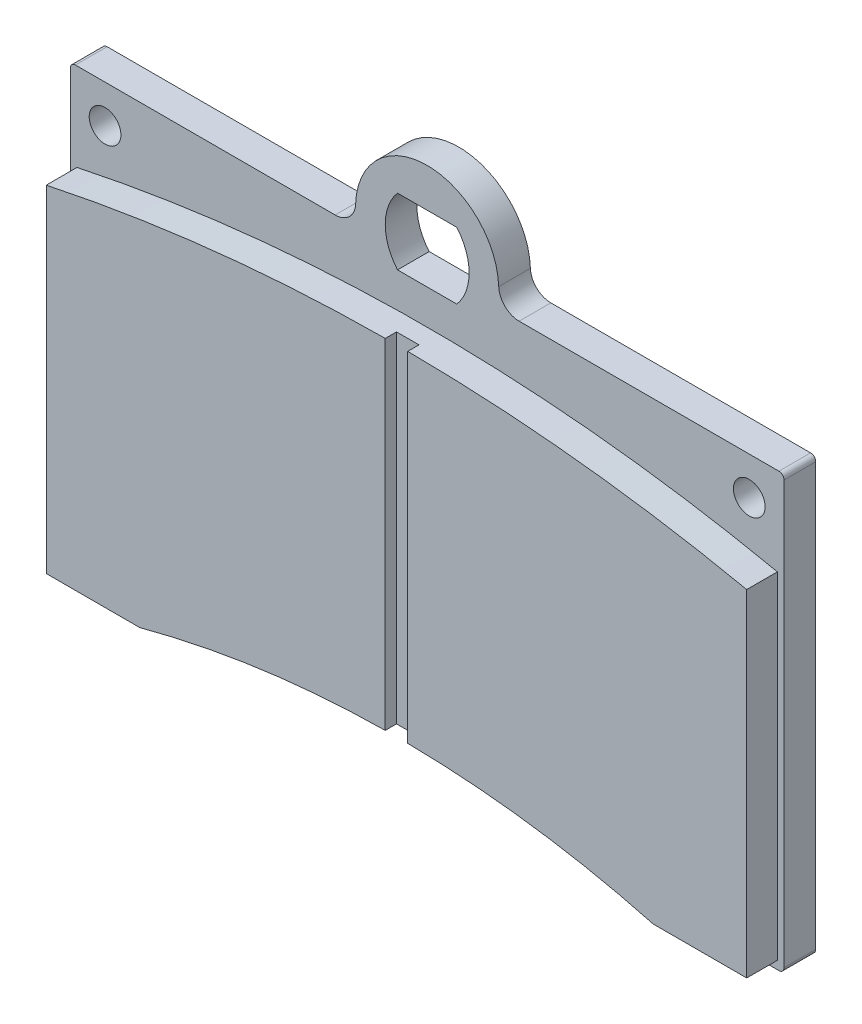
ISO-10303-21;
HEADER;
FILE_DESCRIPTION(('STEP AP214'),'2;1');
FILE_NAME('part.step','',(''),(''),'','','');
FILE_SCHEMA(('AUTOMOTIVE_DESIGN { 1 0 10303 214 1 1 1 1 }'));
ENDSEC;
DATA;
#1=APPLICATION_CONTEXT('core data for automotive mechanical design processes');
#2=APPLICATION_PROTOCOL_DEFINITION('international standard','automotive_design',2000,#1);
#3=PRODUCT_CONTEXT('',#1,'mechanical');
#4=PRODUCT('Part','Part','',(#3));
#5=PRODUCT_RELATED_PRODUCT_CATEGORY('part','',(#4));
#6=PRODUCT_DEFINITION_FORMATION('','',#4);
#7=PRODUCT_DEFINITION_CONTEXT('part definition',#1,'design');
#8=PRODUCT_DEFINITION('design','',#6,#7);
#9=PRODUCT_DEFINITION_SHAPE('','',#8);
#10=(LENGTH_UNIT() NAMED_UNIT(*) SI_UNIT(.MILLI.,.METRE.));
#11=(NAMED_UNIT(*) PLANE_ANGLE_UNIT() SI_UNIT($,.RADIAN.));
#12=(NAMED_UNIT(*) SI_UNIT($,.STERADIAN.) SOLID_ANGLE_UNIT());
#13=UNCERTAINTY_MEASURE_WITH_UNIT(LENGTH_MEASURE(1.E-05),#10,'distance_accuracy_value','');
#14=(GEOMETRIC_REPRESENTATION_CONTEXT(3) GLOBAL_UNCERTAINTY_ASSIGNED_CONTEXT((#13)) GLOBAL_UNIT_ASSIGNED_CONTEXT((#10,
#11,#12)) REPRESENTATION_CONTEXT('',''));
#15=CARTESIAN_POINT('',(0.,0.,0.));
#16=DIRECTION('',(0.,0.,1.));
#17=DIRECTION('',(1.,0.,0.));
#18=AXIS2_PLACEMENT_3D('',#15,#16,#17);
#19=CARTESIAN_POINT('',(0.,42.3,3.1));
#20=DIRECTION('',(0.,-1.,0.));
#21=DIRECTION('',(0.,0.,-1.));
#22=AXIS2_PLACEMENT_3D('',#19,#20,#21);
#23=PLANE('',#22);
#24=DIRECTION('',(-1.,0.,0.));
#25=VECTOR('',#24,1.);
#26=CARTESIAN_POINT('',(0.,42.3,3.1));
#27=LINE('',#26,#25);
#28=CARTESIAN_POINT('',(69.3,42.3,3.1));
#29=VERTEX_POINT('',#28);
#30=CARTESIAN_POINT('',(43.894998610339,42.3,3.1));
#31=VERTEX_POINT('',#30);
#32=EDGE_CURVE('E432',#29,#31,#27,.T.);
#33=ORIENTED_EDGE('',*,*,#32,.F.);
#34=DIRECTION('',(0.,0.,-1.));
#35=VECTOR('',#34,1.);
#36=CARTESIAN_POINT('',(69.3,42.3,3.1));
#37=LINE('',#36,#35);
#38=CARTESIAN_POINT('',(69.3,42.3,0.));
#39=VERTEX_POINT('',#38);
#40=EDGE_CURVE('E361',#29,#39,#37,.T.);
#41=ORIENTED_EDGE('',*,*,#40,.T.);
#42=DIRECTION('',(-1.,0.,0.));
#43=VECTOR('',#42,1.);
#44=CARTESIAN_POINT('',(0.,42.3,0.));
#45=LINE('',#44,#43);
#46=CARTESIAN_POINT('',(43.894998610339,42.3,0.));
#47=VERTEX_POINT('',#46);
#48=EDGE_CURVE('E405',#39,#47,#45,.T.);
#49=ORIENTED_EDGE('',*,*,#48,.T.);
#50=DIRECTION('',(0.,0.,1.));
#51=VECTOR('',#50,1.);
#52=CARTESIAN_POINT('',(43.894998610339,42.3,3.1));
#53=LINE('',#52,#51);
#54=EDGE_CURVE('E337',#47,#31,#53,.T.);
#55=ORIENTED_EDGE('',*,*,#54,.T.);
#56=EDGE_LOOP('',(#33,#41,#49,#55));
#57=FACE_BOUND('',#56,.T.);
#58=ADVANCED_FACE('F36',(#57),#23,.F.);
#59=CARTESIAN_POINT('',(34.9,-127.425347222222,6.1));
#60=DIRECTION('',(0.,0.,-1.));
#61=DIRECTION('',(-1.,0.,0.));
#62=AXIS2_PLACEMENT_3D('',#59,#60,#61);
#63=CYLINDRICAL_SURFACE('',#62,164.725347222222);
#64=CARTESIAN_POINT('',(34.9,-127.425347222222,5.));
#65=DIRECTION('',(0.,0.,-1.));
#66=DIRECTION('',(-1.,0.,0.));
#67=AXIS2_PLACEMENT_3D('',#64,#65,#66);
#68=CIRCLE('',#67,164.725347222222);
#69=CARTESIAN_POINT('',(33.8,37.2963271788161,5.));
#70=VERTEX_POINT('',#69);
#71=CARTESIAN_POINT('',(36.,37.2963271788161,5.));
#72=VERTEX_POINT('',#71);
#73=EDGE_CURVE('E453',#70,#72,#68,.T.);
#74=ORIENTED_EDGE('',*,*,#73,.T.);
#75=DIRECTION('',(0.,0.,-1.));
#76=VECTOR('',#75,1.);
#77=CARTESIAN_POINT('',(36.,37.2963271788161,6.1));
#78=LINE('',#77,#76);
#79=CARTESIAN_POINT('',(36.,37.2963271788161,6.1));
#80=VERTEX_POINT('',#79);
#81=EDGE_CURVE('E834',#72,#80,#78,.F.);
#82=ORIENTED_EDGE('',*,*,#81,.T.);
#83=CARTESIAN_POINT('',(34.9,-127.425347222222,6.1));
#84=DIRECTION('',(0.,0.,1.));
#85=DIRECTION('',(1.,0.,0.));
#86=AXIS2_PLACEMENT_3D('',#83,#84,#85);
#87=CIRCLE('',#86,164.725347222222);
#88=CARTESIAN_POINT('',(69.15,33.7,6.1));
#89=VERTEX_POINT('',#88);
#90=EDGE_CURVE('E822',#89,#80,#87,.T.);
#91=ORIENTED_EDGE('',*,*,#90,.F.);
#92=DIRECTION('',(0.,0.,-1.));
#93=VECTOR('',#92,1.);
#94=CARTESIAN_POINT('',(69.15,33.7,6.1));
#95=LINE('',#94,#93);
#96=CARTESIAN_POINT('',(69.15,33.7,3.1));
#97=VERTEX_POINT('',#96);
#98=EDGE_CURVE('E449',#89,#97,#95,.T.);
#99=ORIENTED_EDGE('',*,*,#98,.T.);
#100=CARTESIAN_POINT('',(34.9,-127.425347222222,3.1));
#101=DIRECTION('',(0.,0.,1.));
#102=DIRECTION('',(1.,0.,0.));
#103=AXIS2_PLACEMENT_3D('',#100,#101,#102);
#104=CIRCLE('',#103,164.725347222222);
#105=CARTESIAN_POINT('',(0.649999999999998,33.7,3.1));
#106=VERTEX_POINT('',#105);
#107=EDGE_CURVE('E450',#97,#106,#104,.T.);
#108=ORIENTED_EDGE('',*,*,#107,.T.);
#109=DIRECTION('',(0.,0.,-1.));
#110=VECTOR('',#109,1.);
#111=CARTESIAN_POINT('',(0.649999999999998,33.7,6.1));
#112=LINE('',#111,#110);
#113=CARTESIAN_POINT('',(0.649999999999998,33.7,6.1));
#114=VERTEX_POINT('',#113);
#115=EDGE_CURVE('E483',#114,#106,#112,.T.);
#116=ORIENTED_EDGE('',*,*,#115,.F.);
#117=CARTESIAN_POINT('',(33.8,37.2963271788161,6.1));
#118=VERTEX_POINT('',#117);
#119=EDGE_CURVE('E468',#118,#114,#87,.T.);
#120=ORIENTED_EDGE('',*,*,#119,.F.);
#121=DIRECTION('',(0.,0.,-1.));
#122=VECTOR('',#121,1.);
#123=CARTESIAN_POINT('',(33.8,37.2963271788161,6.1));
#124=LINE('',#123,#122);
#125=EDGE_CURVE('E827',#118,#70,#124,.T.);
#126=ORIENTED_EDGE('',*,*,#125,.T.);
#127=EDGE_LOOP('',(#74,#82,#91,#99,#108,#116,#120,#126));
#128=FACE_BOUND('',#127,.T.);
#129=ADVANCED_FACE('F552',(#128),#63,.T.);
#130=CARTESIAN_POINT('',(34.9,-127.425347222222,6.1));
#131=DIRECTION('',(0.,0.,1.));
#132=DIRECTION('',(1.,0.,0.));
#133=AXIS2_PLACEMENT_3D('',#130,#131,#132);
#134=PLANE('',#133);
#135=DIRECTION('',(0.,1.,0.));
#136=VECTOR('',#135,1.);
#137=CARTESIAN_POINT('',(36.,37.3,6.1));
#138=LINE('',#137,#136);
#139=CARTESIAN_POINT('',(36.,4.09377212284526,6.1));
#140=VERTEX_POINT('',#139);
#141=EDGE_CURVE('E275',#140,#80,#138,.T.);
#142=ORIENTED_EDGE('',*,*,#141,.F.);
#143=CARTESIAN_POINT('',(34.9,-93.0469696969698,6.1));
#144=DIRECTION('',(0.,0.,-1.));
#145=DIRECTION('',(-1.,0.,0.));
#146=AXIS2_PLACEMENT_3D('',#143,#144,#145);
#147=CIRCLE('',#146,97.1469696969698);
#148=CARTESIAN_POINT('',(60.005377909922,0.799999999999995,6.1));
#149=VERTEX_POINT('',#148);
#150=EDGE_CURVE('E439',#140,#149,#147,.T.);
#151=ORIENTED_EDGE('',*,*,#150,.T.);
#152=DIRECTION('',(1.,0.,0.));
#153=VECTOR('',#152,1.);
#154=CARTESIAN_POINT('',(69.15,0.8,6.1));
#155=LINE('',#154,#153);
#156=CARTESIAN_POINT('',(69.15,0.8,6.1));
#157=VERTEX_POINT('',#156);
#158=EDGE_CURVE('E438',#149,#157,#155,.T.);
#159=ORIENTED_EDGE('',*,*,#158,.T.);
#160=DIRECTION('',(0.,1.,0.));
#161=VECTOR('',#160,1.);
#162=CARTESIAN_POINT('',(69.15,33.7,6.1));
#163=LINE('',#162,#161);
#164=EDGE_CURVE('E447',#157,#89,#163,.T.);
#165=ORIENTED_EDGE('',*,*,#164,.T.);
#166=ORIENTED_EDGE('',*,*,#90,.T.);
#167=EDGE_LOOP('',(#142,#151,#159,#165,#166));
#168=FACE_BOUND('',#167,.T.);
#169=ADVANCED_FACE('F316',(#168),#134,.T.);
#170=CARTESIAN_POINT('',(0.,0.,3.1));
#171=DIRECTION('',(0.,0.,-1.));
#172=DIRECTION('',(-1.,0.,0.));
#173=AXIS2_PLACEMENT_3D('',#170,#171,#172);
#174=PLANE('',#173);
#175=CARTESIAN_POINT('',(66.4,38.6,3.1));
#176=DIRECTION('',(0.,0.,1.));
#177=DIRECTION('',(1.,0.,0.));
#178=AXIS2_PLACEMENT_3D('',#175,#176,#177);
#179=CIRCLE('',#178,1.54999999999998);
#180=CARTESIAN_POINT('',(67.95,38.6,3.1));
#181=VERTEX_POINT('',#180);
#182=EDGE_CURVE('E858',#181,#181,#179,.T.);
#183=ORIENTED_EDGE('',*,*,#182,.F.);
#184=EDGE_LOOP('',(#183));
#185=FACE_BOUND('',#184,.T.);
#186=CARTESIAN_POINT('',(3.4,38.6,3.1));
#187=DIRECTION('',(0.,0.,1.));
#188=DIRECTION('',(1.,0.,0.));
#189=AXIS2_PLACEMENT_3D('',#186,#187,#188);
#190=CIRCLE('',#189,1.54999999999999);
#191=CARTESIAN_POINT('',(4.94999999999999,38.6,3.1));
#192=VERTEX_POINT('',#191);
#193=EDGE_CURVE('E854',#192,#192,#190,.T.);
#194=ORIENTED_EDGE('',*,*,#193,.F.);
#195=EDGE_LOOP('',(#194));
#196=FACE_BOUND('',#195,.T.);
#197=DIRECTION('',(1.,0.,0.));
#198=VECTOR('',#197,1.);
#199=CARTESIAN_POINT('',(32.,40.7,3.1));
#200=LINE('',#199,#198);
#201=CARTESIAN_POINT('',(32.,40.7,3.1));
#202=VERTEX_POINT('',#201);
#203=CARTESIAN_POINT('',(37.8,40.7,3.1));
#204=VERTEX_POINT('',#203);
#205=EDGE_CURVE('E260',#202,#204,#200,.T.);
#206=ORIENTED_EDGE('',*,*,#205,.F.);
#207=CARTESIAN_POINT('',(35.8010416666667,43.95,3.1));
#208=DIRECTION('',(0.,0.,1.));
#209=DIRECTION('',(-1.,0.,0.));
#210=AXIS2_PLACEMENT_3D('',#207,#208,#209);
#211=CIRCLE('',#210,5.00104166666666);
#212=CARTESIAN_POINT('',(32.,47.2,3.1));
#213=VERTEX_POINT('',#212);
#214=EDGE_CURVE('E230',#213,#202,#211,.T.);
#215=ORIENTED_EDGE('',*,*,#214,.F.);
#216=DIRECTION('',(-1.,0.,0.));
#217=VECTOR('',#216,1.);
#218=CARTESIAN_POINT('',(32.,47.2,3.1));
#219=LINE('',#218,#217);
#220=CARTESIAN_POINT('',(37.8,47.2,3.1));
#221=VERTEX_POINT('',#220);
#222=EDGE_CURVE('E248',#221,#213,#219,.T.);
#223=ORIENTED_EDGE('',*,*,#222,.F.);
#224=CARTESIAN_POINT('',(33.9989583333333,43.95,3.1));
#225=DIRECTION('',(0.,0.,1.));
#226=DIRECTION('',(1.,0.,0.));
#227=AXIS2_PLACEMENT_3D('',#224,#225,#226);
#228=CIRCLE('',#227,5.00104166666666);
#229=EDGE_CURVE('E251',#204,#221,#228,.T.);
#230=ORIENTED_EDGE('',*,*,#229,.F.);
#231=EDGE_LOOP('',(#206,#215,#223,#230));
#232=FACE_BOUND('',#231,.T.);
#233=DIRECTION('',(0.,-1.,0.));
#234=VECTOR('',#233,1.);
#235=CARTESIAN_POINT('',(0.649999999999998,33.7,3.1));
#236=LINE('',#235,#234);
#237=CARTESIAN_POINT('',(0.650000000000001,0.8,3.1));
#238=VERTEX_POINT('',#237);
#239=EDGE_CURVE('E452',#106,#238,#236,.T.);
#240=ORIENTED_EDGE('',*,*,#239,.F.);
#241=ORIENTED_EDGE('',*,*,#107,.F.);
#242=DIRECTION('',(0.,1.,0.));
#243=VECTOR('',#242,1.);
#244=CARTESIAN_POINT('',(69.15,33.7,3.1));
#245=LINE('',#244,#243);
#246=CARTESIAN_POINT('',(69.15,0.8,3.1));
#247=VERTEX_POINT('',#246);
#248=EDGE_CURVE('E465',#247,#97,#245,.T.);
#249=ORIENTED_EDGE('',*,*,#248,.F.);
#250=DIRECTION('',(1.,0.,0.));
#251=VECTOR('',#250,1.);
#252=CARTESIAN_POINT('',(69.15,0.8,3.1));
#253=LINE('',#252,#251);
#254=CARTESIAN_POINT('',(60.005377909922,0.799999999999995,3.1));
#255=VERTEX_POINT('',#254);
#256=EDGE_CURVE('E462',#255,#247,#253,.T.);
#257=ORIENTED_EDGE('',*,*,#256,.F.);
#258=CARTESIAN_POINT('',(34.9,-93.0469696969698,3.1));
#259=DIRECTION('',(0.,0.,-1.));
#260=DIRECTION('',(-1.,0.,0.));
#261=AXIS2_PLACEMENT_3D('',#258,#259,#260);
#262=CIRCLE('',#261,97.1469696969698);
#263=CARTESIAN_POINT('',(9.79462209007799,0.799999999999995,3.1));
#264=VERTEX_POINT('',#263);
#265=EDGE_CURVE('E459',#264,#255,#262,.T.);
#266=ORIENTED_EDGE('',*,*,#265,.F.);
#267=DIRECTION('',(1.,0.,0.));
#268=VECTOR('',#267,1.);
#269=CARTESIAN_POINT('',(0.650000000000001,0.8,3.1));
#270=LINE('',#269,#268);
#271=EDGE_CURVE('E456',#238,#264,#270,.T.);
#272=ORIENTED_EDGE('',*,*,#271,.F.);
#273=EDGE_LOOP('',(#240,#241,#249,#257,#266,#272));
#274=FACE_BOUND('',#273,.T.);
#275=DIRECTION('',(0.,1.,0.));
#276=VECTOR('',#275,1.);
#277=CARTESIAN_POINT('',(69.8,0.,3.1));
#278=LINE('',#277,#276);
#279=CARTESIAN_POINT('',(69.8,0.5,3.1));
#280=VERTEX_POINT('',#279);
#281=CARTESIAN_POINT('',(69.8,41.8,3.1));
#282=VERTEX_POINT('',#281);
#283=EDGE_CURVE('E495',#280,#282,#278,.T.);
#284=ORIENTED_EDGE('',*,*,#283,.T.);
#285=CARTESIAN_POINT('',(69.3,41.8,3.1));
#286=DIRECTION('',(0.,0.,-1.));
#287=DIRECTION('',(-1.,0.,0.));
#288=AXIS2_PLACEMENT_3D('',#285,#286,#287);
#289=CIRCLE('',#288,0.5);
#290=EDGE_CURVE('E382',#282,#29,#289,.F.);
#291=ORIENTED_EDGE('',*,*,#290,.T.);
#292=ORIENTED_EDGE('',*,*,#32,.T.);
#293=CARTESIAN_POINT('',(43.894998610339,44.3,3.1));
#294=DIRECTION('',(0.,0.,-1.));
#295=DIRECTION('',(-1.,0.,0.));
#296=AXIS2_PLACEMENT_3D('',#293,#294,#295);
#297=CIRCLE('',#296,2.);
#298=CARTESIAN_POINT('',(41.8961100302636,44.2333333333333,3.1));
#299=VERTEX_POINT('',#298);
#300=EDGE_CURVE('E352',#31,#299,#297,.T.);
#301=ORIENTED_EDGE('',*,*,#300,.T.);
#302=CARTESIAN_POINT('',(34.9,44.,3.1));
#303=DIRECTION('',(0.,0.,1.));
#304=DIRECTION('',(1.,0.,0.));
#305=AXIS2_PLACEMENT_3D('',#302,#303,#304);
#306=CIRCLE('',#305,7.);
#307=CARTESIAN_POINT('',(27.9038899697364,44.2333333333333,3.1));
#308=VERTEX_POINT('',#307);
#309=EDGE_CURVE('E266',#299,#308,#306,.T.);
#310=ORIENTED_EDGE('',*,*,#309,.T.);
#311=CARTESIAN_POINT('',(25.905001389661,44.3,3.1));
#312=DIRECTION('',(0.,0.,-1.));
#313=DIRECTION('',(-1.,0.,0.));
#314=AXIS2_PLACEMENT_3D('',#311,#312,#313);
#315=CIRCLE('',#314,2.);
#316=CARTESIAN_POINT('',(25.905001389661,42.3,3.1));
#317=VERTEX_POINT('',#316);
#318=EDGE_CURVE('E359',#308,#317,#315,.T.);
#319=ORIENTED_EDGE('',*,*,#318,.T.);
#320=CARTESIAN_POINT('',(0.5,42.3,3.1));
#321=VERTEX_POINT('',#320);
#322=EDGE_CURVE('E496',#317,#321,#27,.T.);
#323=ORIENTED_EDGE('',*,*,#322,.T.);
#324=CARTESIAN_POINT('',(0.5,41.8,3.1));
#325=DIRECTION('',(0.,0.,-1.));
#326=DIRECTION('',(-1.,0.,0.));
#327=AXIS2_PLACEMENT_3D('',#324,#325,#326);
#328=CIRCLE('',#327,0.5);
#329=CARTESIAN_POINT('',(0.,41.8,3.1));
#330=VERTEX_POINT('',#329);
#331=EDGE_CURVE('E377',#321,#330,#328,.F.);
#332=ORIENTED_EDGE('',*,*,#331,.T.);
#333=DIRECTION('',(0.,-1.,0.));
#334=VECTOR('',#333,1.);
#335=CARTESIAN_POINT('',(0.,0.,3.1));
#336=LINE('',#335,#334);
#337=CARTESIAN_POINT('',(0.,0.5,3.1));
#338=VERTEX_POINT('',#337);
#339=EDGE_CURVE('E395',#330,#338,#336,.T.);
#340=ORIENTED_EDGE('',*,*,#339,.T.);
#341=CARTESIAN_POINT('',(0.5,0.5,3.1));
#342=DIRECTION('',(0.,0.,-1.));
#343=DIRECTION('',(-1.,0.,0.));
#344=AXIS2_PLACEMENT_3D('',#341,#342,#343);
#345=CIRCLE('',#344,0.5);
#346=CARTESIAN_POINT('',(0.5,0.,3.1));
#347=VERTEX_POINT('',#346);
#348=EDGE_CURVE('E59',#338,#347,#345,.F.);
#349=ORIENTED_EDGE('',*,*,#348,.T.);
#350=DIRECTION('',(1.,0.,0.));
#351=VECTOR('',#350,1.);
#352=CARTESIAN_POINT('',(0.,0.,3.1));
#353=LINE('',#352,#351);
#354=CARTESIAN_POINT('',(9.9,0.,3.1));
#355=VERTEX_POINT('',#354);
#356=EDGE_CURVE('E415',#347,#355,#353,.T.);
#357=ORIENTED_EDGE('',*,*,#356,.T.);
#358=CARTESIAN_POINT('',(34.9,-93.0469696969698,3.1));
#359=DIRECTION('',(0.,0.,1.));
#360=DIRECTION('',(-1.,0.,0.));
#361=AXIS2_PLACEMENT_3D('',#358,#359,#360);
#362=CIRCLE('',#361,96.3469696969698);
#363=CARTESIAN_POINT('',(59.9,0.,3.1));
#364=VERTEX_POINT('',#363);
#365=EDGE_CURVE('E486',#364,#355,#362,.T.);
#366=ORIENTED_EDGE('',*,*,#365,.F.);
#367=CARTESIAN_POINT('',(69.3,0.,3.1));
#368=VERTEX_POINT('',#367);
#369=EDGE_CURVE('E404',#364,#368,#353,.T.);
#370=ORIENTED_EDGE('',*,*,#369,.T.);
#371=CARTESIAN_POINT('',(69.3,0.5,3.1));
#372=DIRECTION('',(0.,0.,-1.));
#373=DIRECTION('',(-1.,0.,0.));
#374=AXIS2_PLACEMENT_3D('',#371,#372,#373);
#375=CIRCLE('',#374,0.5);
#376=EDGE_CURVE('E380',#368,#280,#375,.F.);
#377=ORIENTED_EDGE('',*,*,#376,.T.);
#378=EDGE_LOOP('',(#284,#291,#292,#301,#310,#319,#323,#332,#340,#349,#357,#366,#370,#377));
#379=FACE_BOUND('',#378,.T.);
#380=ADVANCED_FACE('F401',(#185,#196,#232,#274,#379),#174,.F.);
#381=CARTESIAN_POINT('',(0.,0.,3.1));
#382=DIRECTION('',(0.,1.,0.));
#383=DIRECTION('',(0.,0.,1.));
#384=AXIS2_PLACEMENT_3D('',#381,#382,#383);
#385=PLANE('',#384);
#386=ORIENTED_EDGE('',*,*,#356,.F.);
#387=DIRECTION('',(0.,0.,-1.));
#388=VECTOR('',#387,1.);
#389=CARTESIAN_POINT('',(0.5,0.,3.1));
#390=LINE('',#389,#388);
#391=CARTESIAN_POINT('',(0.5,0.,0.));
#392=VERTEX_POINT('',#391);
#393=EDGE_CURVE('E385',#347,#392,#390,.T.);
#394=ORIENTED_EDGE('',*,*,#393,.T.);
#395=DIRECTION('',(1.,0.,0.));
#396=VECTOR('',#395,1.);
#397=CARTESIAN_POINT('',(0.,0.,0.));
#398=LINE('',#397,#396);
#399=CARTESIAN_POINT('',(9.9,0.,0.));
#400=VERTEX_POINT('',#399);
#401=EDGE_CURVE('E413',#392,#400,#398,.T.);
#402=ORIENTED_EDGE('',*,*,#401,.T.);
#403=DIRECTION('',(0.,0.,1.));
#404=VECTOR('',#403,1.);
#405=CARTESIAN_POINT('',(9.9,0.,0.));
#406=LINE('',#405,#404);
#407=EDGE_CURVE('E488',#400,#355,#406,.T.);
#408=ORIENTED_EDGE('',*,*,#407,.T.);
#409=EDGE_LOOP('',(#386,#394,#402,#408));
#410=FACE_BOUND('',#409,.T.);
#411=ADVANCED_FACE('F411',(#410),#385,.F.);
#412=CARTESIAN_POINT('',(0.,0.,3.1));
#413=DIRECTION('',(1.,0.,0.));
#414=DIRECTION('',(0.,0.,-1.));
#415=AXIS2_PLACEMENT_3D('',#412,#413,#414);
#416=PLANE('',#415);
#417=DIRECTION('',(0.,-1.,0.));
#418=VECTOR('',#417,1.);
#419=CARTESIAN_POINT('',(0.,0.,0.));
#420=LINE('',#419,#418);
#421=CARTESIAN_POINT('',(0.,41.8,0.));
#422=VERTEX_POINT('',#421);
#423=CARTESIAN_POINT('',(0.,0.5,0.));
#424=VERTEX_POINT('',#423);
#425=EDGE_CURVE('E398',#422,#424,#420,.T.);
#426=ORIENTED_EDGE('',*,*,#425,.T.);
#427=DIRECTION('',(0.,0.,-1.));
#428=VECTOR('',#427,1.);
#429=CARTESIAN_POINT('',(0.,0.5,3.1));
#430=LINE('',#429,#428);
#431=EDGE_CURVE('E44',#424,#338,#430,.F.);
#432=ORIENTED_EDGE('',*,*,#431,.T.);
#433=ORIENTED_EDGE('',*,*,#339,.F.);
#434=DIRECTION('',(0.,0.,-1.));
#435=VECTOR('',#434,1.);
#436=CARTESIAN_POINT('',(0.,41.8,3.1));
#437=LINE('',#436,#435);
#438=EDGE_CURVE('E388',#330,#422,#437,.T.);
#439=ORIENTED_EDGE('',*,*,#438,.T.);
#440=EDGE_LOOP('',(#426,#432,#433,#439));
#441=FACE_BOUND('',#440,.T.);
#442=ADVANCED_FACE('F394',(#441),#416,.F.);
#443=CARTESIAN_POINT('',(59.9,0.,0.));
#444=VERTEX_POINT('',#443);
#445=CARTESIAN_POINT('',(69.3,0.,0.));
#446=VERTEX_POINT('',#445);
#447=EDGE_CURVE('E421',#444,#446,#398,.T.);
#448=ORIENTED_EDGE('',*,*,#447,.T.);
#449=DIRECTION('',(0.,0.,-1.));
#450=VECTOR('',#449,1.);
#451=CARTESIAN_POINT('',(69.3,0.,3.1));
#452=LINE('',#451,#450);
#453=EDGE_CURVE('E51',#446,#368,#452,.F.);
#454=ORIENTED_EDGE('',*,*,#453,.T.);
#455=ORIENTED_EDGE('',*,*,#369,.F.);
#456=DIRECTION('',(0.,0.,1.));
#457=VECTOR('',#456,1.);
#458=CARTESIAN_POINT('',(59.9,0.,0.));
#459=LINE('',#458,#457);
#460=EDGE_CURVE('E491',#444,#364,#459,.T.);
#461=ORIENTED_EDGE('',*,*,#460,.F.);
#462=EDGE_LOOP('',(#448,#454,#455,#461));
#463=FACE_BOUND('',#462,.T.);
#464=ADVANCED_FACE('F536',(#463),#385,.F.);
#465=CARTESIAN_POINT('',(69.8,0.,3.1));
#466=DIRECTION('',(-1.,0.,0.));
#467=DIRECTION('',(0.,0.,1.));
#468=AXIS2_PLACEMENT_3D('',#465,#466,#467);
#469=PLANE('',#468);
#470=DIRECTION('',(0.,1.,0.));
#471=VECTOR('',#470,1.);
#472=CARTESIAN_POINT('',(69.8,0.,0.));
#473=LINE('',#472,#471);
#474=CARTESIAN_POINT('',(69.8,0.5,0.));
#475=VERTEX_POINT('',#474);
#476=CARTESIAN_POINT('',(69.8,41.8,0.));
#477=VERTEX_POINT('',#476);
#478=EDGE_CURVE('E420',#475,#477,#473,.T.);
#479=ORIENTED_EDGE('',*,*,#478,.T.);
#480=DIRECTION('',(0.,0.,-1.));
#481=VECTOR('',#480,1.);
#482=CARTESIAN_POINT('',(69.8,41.8,3.1));
#483=LINE('',#482,#481);
#484=EDGE_CURVE('E375',#477,#282,#483,.F.);
#485=ORIENTED_EDGE('',*,*,#484,.T.);
#486=ORIENTED_EDGE('',*,*,#283,.F.);
#487=DIRECTION('',(0.,0.,-1.));
#488=VECTOR('',#487,1.);
#489=CARTESIAN_POINT('',(69.8,0.5,3.1));
#490=LINE('',#489,#488);
#491=EDGE_CURVE('E372',#280,#475,#490,.T.);
#492=ORIENTED_EDGE('',*,*,#491,.T.);
#493=EDGE_LOOP('',(#479,#485,#486,#492));
#494=FACE_BOUND('',#493,.T.);
#495=ADVANCED_FACE('F529',(#494),#469,.F.);
#496=CARTESIAN_POINT('',(25.905001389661,42.3,0.));
#497=VERTEX_POINT('',#496);
#498=CARTESIAN_POINT('',(0.5,42.3,0.));
#499=VERTEX_POINT('',#498);
#500=EDGE_CURVE('E424',#497,#499,#45,.T.);
#501=ORIENTED_EDGE('',*,*,#500,.T.);
#502=DIRECTION('',(0.,0.,-1.));
#503=VECTOR('',#502,1.);
#504=CARTESIAN_POINT('',(0.5,42.3,3.1));
#505=LINE('',#504,#503);
#506=EDGE_CURVE('E12',#499,#321,#505,.F.);
#507=ORIENTED_EDGE('',*,*,#506,.T.);
#508=ORIENTED_EDGE('',*,*,#322,.F.);
#509=DIRECTION('',(0.,0.,1.));
#510=VECTOR('',#509,1.);
#511=CARTESIAN_POINT('',(25.905001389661,42.3,3.1));
#512=LINE('',#511,#510);
#513=EDGE_CURVE('E349',#317,#497,#512,.F.);
#514=ORIENTED_EDGE('',*,*,#513,.T.);
#515=EDGE_LOOP('',(#501,#507,#508,#514));
#516=FACE_BOUND('',#515,.T.);
#517=ADVANCED_FACE('F507',(#516),#23,.F.);
#518=CARTESIAN_POINT('',(0.,0.,0.));
#519=DIRECTION('',(0.,0.,-1.));
#520=DIRECTION('',(-1.,0.,0.));
#521=AXIS2_PLACEMENT_3D('',#518,#519,#520);
#522=PLANE('',#521);
#523=CARTESIAN_POINT('',(66.4,38.6,0.));
#524=DIRECTION('',(0.,0.,1.));
#525=DIRECTION('',(1.,0.,0.));
#526=AXIS2_PLACEMENT_3D('',#523,#524,#525);
#527=CIRCLE('',#526,1.55);
#528=CARTESIAN_POINT('',(67.95,38.6,0.));
#529=VERTEX_POINT('',#528);
#530=EDGE_CURVE('E856',#529,#529,#527,.T.);
#531=ORIENTED_EDGE('',*,*,#530,.T.);
#532=EDGE_LOOP('',(#531));
#533=FACE_BOUND('',#532,.T.);
#534=CARTESIAN_POINT('',(3.4,38.6,0.));
#535=DIRECTION('',(0.,0.,1.));
#536=DIRECTION('',(1.,0.,0.));
#537=AXIS2_PLACEMENT_3D('',#534,#535,#536);
#538=CIRCLE('',#537,1.55);
#539=CARTESIAN_POINT('',(4.95,38.6,0.));
#540=VERTEX_POINT('',#539);
#541=EDGE_CURVE('E254',#540,#540,#538,.T.);
#542=ORIENTED_EDGE('',*,*,#541,.T.);
#543=EDGE_LOOP('',(#542));
#544=FACE_BOUND('',#543,.T.);
#545=CARTESIAN_POINT('',(35.8010416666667,43.95,0.));
#546=DIRECTION('',(0.,0.,1.));
#547=DIRECTION('',(-1.,0.,0.));
#548=AXIS2_PLACEMENT_3D('',#545,#546,#547);
#549=CIRCLE('',#548,5.00104166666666);
#550=CARTESIAN_POINT('',(32.,47.2,0.));
#551=VERTEX_POINT('',#550);
#552=CARTESIAN_POINT('',(32.,40.7,0.));
#553=VERTEX_POINT('',#552);
#554=EDGE_CURVE('E227',#551,#553,#549,.T.);
#555=ORIENTED_EDGE('',*,*,#554,.T.);
#556=DIRECTION('',(1.,0.,0.));
#557=VECTOR('',#556,1.);
#558=CARTESIAN_POINT('',(32.,40.7,0.));
#559=LINE('',#558,#557);
#560=CARTESIAN_POINT('',(37.8,40.7,0.));
#561=VERTEX_POINT('',#560);
#562=EDGE_CURVE('E239',#553,#561,#559,.T.);
#563=ORIENTED_EDGE('',*,*,#562,.T.);
#564=CARTESIAN_POINT('',(33.9989583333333,43.95,0.));
#565=DIRECTION('',(0.,0.,1.));
#566=DIRECTION('',(1.,0.,0.));
#567=AXIS2_PLACEMENT_3D('',#564,#565,#566);
#568=CIRCLE('',#567,5.00104166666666);
#569=CARTESIAN_POINT('',(37.8,47.2,0.));
#570=VERTEX_POINT('',#569);
#571=EDGE_CURVE('E243',#561,#570,#568,.T.);
#572=ORIENTED_EDGE('',*,*,#571,.T.);
#573=DIRECTION('',(-1.,0.,0.));
#574=VECTOR('',#573,1.);
#575=CARTESIAN_POINT('',(32.,47.2,0.));
#576=LINE('',#575,#574);
#577=EDGE_CURVE('E235',#570,#551,#576,.T.);
#578=ORIENTED_EDGE('',*,*,#577,.T.);
#579=EDGE_LOOP('',(#555,#563,#572,#578));
#580=FACE_BOUND('',#579,.T.);
#581=ORIENTED_EDGE('',*,*,#48,.F.);
#582=CARTESIAN_POINT('',(69.3,41.8,0.));
#583=DIRECTION('',(0.,0.,-1.));
#584=DIRECTION('',(-1.,0.,0.));
#585=AXIS2_PLACEMENT_3D('',#582,#583,#584);
#586=CIRCLE('',#585,0.5);
#587=EDGE_CURVE('E370',#39,#477,#586,.T.);
#588=ORIENTED_EDGE('',*,*,#587,.T.);
#589=ORIENTED_EDGE('',*,*,#478,.F.);
#590=CARTESIAN_POINT('',(69.3,0.5,0.));
#591=DIRECTION('',(0.,0.,-1.));
#592=DIRECTION('',(-1.,0.,0.));
#593=AXIS2_PLACEMENT_3D('',#590,#591,#592);
#594=CIRCLE('',#593,0.5);
#595=EDGE_CURVE('E368',#475,#446,#594,.T.);
#596=ORIENTED_EDGE('',*,*,#595,.T.);
#597=ORIENTED_EDGE('',*,*,#447,.F.);
#598=CARTESIAN_POINT('',(34.9,-93.0469696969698,0.));
#599=DIRECTION('',(0.,0.,1.));
#600=DIRECTION('',(-1.,0.,0.));
#601=AXIS2_PLACEMENT_3D('',#598,#599,#600);
#602=CIRCLE('',#601,96.3469696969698);
#603=EDGE_CURVE('E419',#444,#400,#602,.T.);
#604=ORIENTED_EDGE('',*,*,#603,.T.);
#605=ORIENTED_EDGE('',*,*,#401,.F.);
#606=CARTESIAN_POINT('',(0.5,0.5,0.));
#607=DIRECTION('',(0.,0.,-1.));
#608=DIRECTION('',(-1.,0.,0.));
#609=AXIS2_PLACEMENT_3D('',#606,#607,#608);
#610=CIRCLE('',#609,0.5);
#611=EDGE_CURVE('E366',#392,#424,#610,.T.);
#612=ORIENTED_EDGE('',*,*,#611,.T.);
#613=ORIENTED_EDGE('',*,*,#425,.F.);
#614=CARTESIAN_POINT('',(0.5,41.8,0.));
#615=DIRECTION('',(0.,0.,-1.));
#616=DIRECTION('',(-1.,0.,0.));
#617=AXIS2_PLACEMENT_3D('',#614,#615,#616);
#618=CIRCLE('',#617,0.5);
#619=EDGE_CURVE('E364',#422,#499,#618,.T.);
#620=ORIENTED_EDGE('',*,*,#619,.T.);
#621=ORIENTED_EDGE('',*,*,#500,.F.);
#622=CARTESIAN_POINT('',(25.905001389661,44.3,0.));
#623=DIRECTION('',(0.,0.,-1.));
#624=DIRECTION('',(-1.,0.,0.));
#625=AXIS2_PLACEMENT_3D('',#622,#623,#624);
#626=CIRCLE('',#625,2.);
#627=CARTESIAN_POINT('',(27.9038899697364,44.2333333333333,0.));
#628=VERTEX_POINT('',#627);
#629=EDGE_CURVE('E357',#497,#628,#626,.F.);
#630=ORIENTED_EDGE('',*,*,#629,.T.);
#631=CARTESIAN_POINT('',(34.9,44.,0.));
#632=DIRECTION('',(0.,0.,-1.));
#633=DIRECTION('',(-1.,0.,0.));
#634=AXIS2_PLACEMENT_3D('',#631,#632,#633);
#635=CIRCLE('',#634,7.);
#636=CARTESIAN_POINT('',(41.8961100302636,44.2333333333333,0.));
#637=VERTEX_POINT('',#636);
#638=EDGE_CURVE('E272',#637,#628,#635,.F.);
#639=ORIENTED_EDGE('',*,*,#638,.F.);
#640=CARTESIAN_POINT('',(43.894998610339,44.3,0.));
#641=DIRECTION('',(0.,0.,-1.));
#642=DIRECTION('',(-1.,0.,0.));
#643=AXIS2_PLACEMENT_3D('',#640,#641,#642);
#644=CIRCLE('',#643,2.);
#645=EDGE_CURVE('E354',#637,#47,#644,.F.);
#646=ORIENTED_EDGE('',*,*,#645,.T.);
#647=EDGE_LOOP('',(#581,#588,#589,#596,#597,#604,#605,#612,#613,#620,#621,#630,#639,#646));
#648=FACE_BOUND('',#647,.T.);
#649=ADVANCED_FACE('F245',(#533,#544,#580,#648),#522,.T.);
#650=CARTESIAN_POINT('',(34.9,-93.0469696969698,0.));
#651=DIRECTION('',(0.,0.,1.));
#652=DIRECTION('',(1.,0.,0.));
#653=AXIS2_PLACEMENT_3D('',#650,#651,#652);
#654=CYLINDRICAL_SURFACE('',#653,96.3469696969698);
#655=ORIENTED_EDGE('',*,*,#365,.T.);
#656=ORIENTED_EDGE('',*,*,#407,.F.);
#657=ORIENTED_EDGE('',*,*,#603,.F.);
#658=ORIENTED_EDGE('',*,*,#460,.T.);
#659=EDGE_LOOP('',(#655,#656,#657,#658));
#660=FACE_BOUND('',#659,.T.);
#661=ADVANCED_FACE('F538',(#660),#654,.F.);
#662=CARTESIAN_POINT('',(0.649999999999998,33.7,6.1));
#663=DIRECTION('',(1.,0.,0.));
#664=DIRECTION('',(0.,1.,0.));
#665=AXIS2_PLACEMENT_3D('',#662,#663,#664);
#666=PLANE('',#665);
#667=ORIENTED_EDGE('',*,*,#239,.T.);
#668=DIRECTION('',(0.,0.,-1.));
#669=VECTOR('',#668,1.);
#670=CARTESIAN_POINT('',(0.650000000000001,0.8,6.1));
#671=LINE('',#670,#669);
#672=CARTESIAN_POINT('',(0.650000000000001,0.8,6.1));
#673=VERTEX_POINT('',#672);
#674=EDGE_CURVE('E480',#673,#238,#671,.T.);
#675=ORIENTED_EDGE('',*,*,#674,.F.);
#676=DIRECTION('',(0.,-1.,0.));
#677=VECTOR('',#676,1.);
#678=CARTESIAN_POINT('',(0.649999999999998,33.7,6.1));
#679=LINE('',#678,#677);
#680=EDGE_CURVE('E821',#114,#673,#679,.T.);
#681=ORIENTED_EDGE('',*,*,#680,.F.);
#682=ORIENTED_EDGE('',*,*,#115,.T.);
#683=EDGE_LOOP('',(#667,#675,#681,#682));
#684=FACE_BOUND('',#683,.T.);
#685=ADVANCED_FACE('F540',(#684),#666,.F.);
#686=CARTESIAN_POINT('',(0.650000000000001,0.8,6.1));
#687=DIRECTION('',(0.,1.,0.));
#688=DIRECTION('',(-1.,0.,0.));
#689=AXIS2_PLACEMENT_3D('',#686,#687,#688);
#690=PLANE('',#689);
#691=ORIENTED_EDGE('',*,*,#271,.T.);
#692=DIRECTION('',(0.,0.,-1.));
#693=VECTOR('',#692,1.);
#694=CARTESIAN_POINT('',(9.79462209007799,0.799999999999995,6.1));
#695=LINE('',#694,#693);
#696=CARTESIAN_POINT('',(9.79462209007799,0.799999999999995,6.1));
#697=VERTEX_POINT('',#696);
#698=EDGE_CURVE('E477',#697,#264,#695,.T.);
#699=ORIENTED_EDGE('',*,*,#698,.F.);
#700=DIRECTION('',(1.,0.,0.));
#701=VECTOR('',#700,1.);
#702=CARTESIAN_POINT('',(0.650000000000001,0.8,6.1));
#703=LINE('',#702,#701);
#704=EDGE_CURVE('E443',#673,#697,#703,.T.);
#705=ORIENTED_EDGE('',*,*,#704,.F.);
#706=ORIENTED_EDGE('',*,*,#674,.T.);
#707=EDGE_LOOP('',(#691,#699,#705,#706));
#708=FACE_BOUND('',#707,.T.);
#709=ADVANCED_FACE('F328',(#708),#690,.F.);
#710=CARTESIAN_POINT('',(34.9,-93.0469696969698,6.1));
#711=DIRECTION('',(0.,0.,-1.));
#712=DIRECTION('',(-1.,0.,0.));
#713=AXIS2_PLACEMENT_3D('',#710,#711,#712);
#714=CYLINDRICAL_SURFACE('',#713,97.1469696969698);
#715=ORIENTED_EDGE('',*,*,#150,.F.);
#716=DIRECTION('',(0.,0.,1.));
#717=VECTOR('',#716,1.);
#718=CARTESIAN_POINT('',(36.,4.09377212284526,-33.2790259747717));
#719=LINE('',#718,#717);
#720=CARTESIAN_POINT('',(36.,4.09377212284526,5.));
#721=VERTEX_POINT('',#720);
#722=EDGE_CURVE('E283',#721,#140,#719,.T.);
#723=ORIENTED_EDGE('',*,*,#722,.F.);
#724=CARTESIAN_POINT('',(34.9,-93.0469696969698,5.));
#725=DIRECTION('',(0.,0.,1.));
#726=DIRECTION('',(0.011323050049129,0.999935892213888,0.));
#727=AXIS2_PLACEMENT_3D('',#724,#725,#726);
#728=CIRCLE('',#727,97.1469696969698);
#729=CARTESIAN_POINT('',(33.8,4.09377212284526,5.));
#730=VERTEX_POINT('',#729);
#731=EDGE_CURVE('E291',#721,#730,#728,.T.);
#732=ORIENTED_EDGE('',*,*,#731,.T.);
#733=DIRECTION('',(0.,0.,1.));
#734=VECTOR('',#733,1.);
#735=CARTESIAN_POINT('',(33.8,4.09377212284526,-33.2790259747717));
#736=LINE('',#735,#734);
#737=CARTESIAN_POINT('',(33.8,4.09377212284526,6.1));
#738=VERTEX_POINT('',#737);
#739=EDGE_CURVE('E817',#730,#738,#736,.T.);
#740=ORIENTED_EDGE('',*,*,#739,.T.);
#741=EDGE_CURVE('E435',#697,#738,#147,.T.);
#742=ORIENTED_EDGE('',*,*,#741,.F.);
#743=ORIENTED_EDGE('',*,*,#698,.T.);
#744=ORIENTED_EDGE('',*,*,#265,.T.);
#745=DIRECTION('',(0.,0.,-1.));
#746=VECTOR('',#745,1.);
#747=CARTESIAN_POINT('',(60.005377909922,0.799999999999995,6.1));
#748=LINE('',#747,#746);
#749=EDGE_CURVE('E474',#149,#255,#748,.T.);
#750=ORIENTED_EDGE('',*,*,#749,.F.);
#751=EDGE_LOOP('',(#715,#723,#732,#740,#742,#743,#744,#750));
#752=FACE_BOUND('',#751,.T.);
#753=ADVANCED_FACE('F323',(#752),#714,.F.);
#754=CARTESIAN_POINT('',(69.15,0.8,6.1));
#755=DIRECTION('',(0.,1.,0.));
#756=DIRECTION('',(-1.,0.,0.));
#757=AXIS2_PLACEMENT_3D('',#754,#755,#756);
#758=PLANE('',#757);
#759=ORIENTED_EDGE('',*,*,#256,.T.);
#760=DIRECTION('',(0.,0.,-1.));
#761=VECTOR('',#760,1.);
#762=CARTESIAN_POINT('',(69.15,0.8,6.1));
#763=LINE('',#762,#761);
#764=EDGE_CURVE('E471',#157,#247,#763,.T.);
#765=ORIENTED_EDGE('',*,*,#764,.F.);
#766=ORIENTED_EDGE('',*,*,#158,.F.);
#767=ORIENTED_EDGE('',*,*,#749,.T.);
#768=EDGE_LOOP('',(#759,#765,#766,#767));
#769=FACE_BOUND('',#768,.T.);
#770=ADVANCED_FACE('F319',(#769),#758,.F.);
#771=CARTESIAN_POINT('',(69.15,33.7,6.1));
#772=DIRECTION('',(-1.,0.,0.));
#773=DIRECTION('',(0.,0.,1.));
#774=AXIS2_PLACEMENT_3D('',#771,#772,#773);
#775=PLANE('',#774);
#776=ORIENTED_EDGE('',*,*,#248,.T.);
#777=ORIENTED_EDGE('',*,*,#98,.F.);
#778=ORIENTED_EDGE('',*,*,#164,.F.);
#779=ORIENTED_EDGE('',*,*,#764,.T.);
#780=EDGE_LOOP('',(#776,#777,#778,#779));
#781=FACE_BOUND('',#780,.T.);
#782=ADVANCED_FACE('F314',(#781),#775,.F.);
#783=DIRECTION('',(0.,-1.,0.));
#784=VECTOR('',#783,1.);
#785=CARTESIAN_POINT('',(33.8,-127.425347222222,6.1));
#786=LINE('',#785,#784);
#787=EDGE_CURVE('E430',#118,#738,#786,.T.);
#788=ORIENTED_EDGE('',*,*,#787,.F.);
#789=ORIENTED_EDGE('',*,*,#119,.T.);
#790=ORIENTED_EDGE('',*,*,#680,.T.);
#791=ORIENTED_EDGE('',*,*,#704,.T.);
#792=ORIENTED_EDGE('',*,*,#741,.T.);
#793=EDGE_LOOP('',(#788,#789,#790,#791,#792));
#794=FACE_BOUND('',#793,.T.);
#795=ADVANCED_FACE('F310',(#794),#134,.T.);
#796=CARTESIAN_POINT('',(0.,0.,5.));
#797=DIRECTION('',(0.,0.,-1.));
#798=DIRECTION('',(-1.,0.,0.));
#799=AXIS2_PLACEMENT_3D('',#796,#797,#798);
#800=PLANE('',#799);
#801=DIRECTION('',(0.,-1.,0.));
#802=VECTOR('',#801,1.);
#803=CARTESIAN_POINT('',(33.8,37.3,5.));
#804=LINE('',#803,#802);
#805=EDGE_CURVE('E825',#70,#730,#804,.T.);
#806=ORIENTED_EDGE('',*,*,#805,.T.);
#807=ORIENTED_EDGE('',*,*,#731,.F.);
#808=DIRECTION('',(0.,1.,0.));
#809=VECTOR('',#808,1.);
#810=CARTESIAN_POINT('',(36.,37.3,5.));
#811=LINE('',#810,#809);
#812=EDGE_CURVE('E297',#721,#72,#811,.T.);
#813=ORIENTED_EDGE('',*,*,#812,.T.);
#814=ORIENTED_EDGE('',*,*,#73,.F.);
#815=EDGE_LOOP('',(#806,#807,#813,#814));
#816=FACE_BOUND('',#815,.T.);
#817=ADVANCED_FACE('F299',(#816),#800,.F.);
#818=CARTESIAN_POINT('',(36.,37.3,-33.2790259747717));
#819=DIRECTION('',(1.,0.,0.));
#820=DIRECTION('',(0.,1.,0.));
#821=AXIS2_PLACEMENT_3D('',#818,#819,#820);
#822=PLANE('',#821);
#823=ORIENTED_EDGE('',*,*,#812,.F.);
#824=ORIENTED_EDGE('',*,*,#722,.T.);
#825=ORIENTED_EDGE('',*,*,#141,.T.);
#826=ORIENTED_EDGE('',*,*,#81,.F.);
#827=EDGE_LOOP('',(#823,#824,#825,#826));
#828=FACE_BOUND('',#827,.T.);
#829=ADVANCED_FACE('F309',(#828),#822,.F.);
#830=CARTESIAN_POINT('',(33.8,37.3,-33.2790259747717));
#831=DIRECTION('',(-1.,0.,0.));
#832=DIRECTION('',(0.,0.,1.));
#833=AXIS2_PLACEMENT_3D('',#830,#831,#832);
#834=PLANE('',#833);
#835=ORIENTED_EDGE('',*,*,#787,.T.);
#836=ORIENTED_EDGE('',*,*,#739,.F.);
#837=ORIENTED_EDGE('',*,*,#805,.F.);
#838=ORIENTED_EDGE('',*,*,#125,.F.);
#839=EDGE_LOOP('',(#835,#836,#837,#838));
#840=FACE_BOUND('',#839,.T.);
#841=ADVANCED_FACE('F726',(#840),#834,.F.);
#842=CARTESIAN_POINT('',(34.9,44.,-19.7989898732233));
#843=DIRECTION('',(0.,0.,1.));
#844=DIRECTION('',(1.,0.,0.));
#845=AXIS2_PLACEMENT_3D('',#842,#843,#844);
#846=CYLINDRICAL_SURFACE('',#845,7.);
#847=ORIENTED_EDGE('',*,*,#309,.F.);
#848=DIRECTION('',(0.,0.,1.));
#849=VECTOR('',#848,1.);
#850=CARTESIAN_POINT('',(41.8961100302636,44.2333333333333,-19.7989898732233));
#851=LINE('',#850,#849);
#852=EDGE_CURVE('E347',#299,#637,#851,.F.);
#853=ORIENTED_EDGE('',*,*,#852,.T.);
#854=ORIENTED_EDGE('',*,*,#638,.T.);
#855=DIRECTION('',(0.,0.,1.));
#856=VECTOR('',#855,1.);
#857=CARTESIAN_POINT('',(27.9038899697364,44.2333333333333,-19.7989898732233));
#858=LINE('',#857,#856);
#859=EDGE_CURVE('E345',#628,#308,#858,.T.);
#860=ORIENTED_EDGE('',*,*,#859,.T.);
#861=EDGE_LOOP('',(#847,#853,#854,#860));
#862=FACE_BOUND('',#861,.T.);
#863=ADVANCED_FACE('F515',(#862),#846,.T.);
#864=CARTESIAN_POINT('',(43.894998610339,44.3,-19.7989898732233));
#865=DIRECTION('',(0.,0.,1.));
#866=DIRECTION('',(1.,0.,0.));
#867=AXIS2_PLACEMENT_3D('',#864,#865,#866);
#868=CYLINDRICAL_SURFACE('',#867,2.);
#869=ORIENTED_EDGE('',*,*,#645,.F.);
#870=ORIENTED_EDGE('',*,*,#852,.F.);
#871=ORIENTED_EDGE('',*,*,#300,.F.);
#872=ORIENTED_EDGE('',*,*,#54,.F.);
#873=EDGE_LOOP('',(#869,#870,#871,#872));
#874=FACE_BOUND('',#873,.T.);
#875=ADVANCED_FACE('F518',(#874),#868,.F.);
#876=CARTESIAN_POINT('',(25.905001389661,44.3,-19.7989898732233));
#877=DIRECTION('',(0.,0.,1.));
#878=DIRECTION('',(1.,0.,0.));
#879=AXIS2_PLACEMENT_3D('',#876,#877,#878);
#880=CYLINDRICAL_SURFACE('',#879,2.);
#881=ORIENTED_EDGE('',*,*,#318,.F.);
#882=ORIENTED_EDGE('',*,*,#859,.F.);
#883=ORIENTED_EDGE('',*,*,#629,.F.);
#884=ORIENTED_EDGE('',*,*,#513,.F.);
#885=EDGE_LOOP('',(#881,#882,#883,#884));
#886=FACE_BOUND('',#885,.T.);
#887=ADVANCED_FACE('F509',(#886),#880,.F.);
#888=CARTESIAN_POINT('',(35.8010416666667,43.95,0.));
#889=DIRECTION('',(0.,0.,1.));
#890=DIRECTION('',(1.,0.,0.));
#891=AXIS2_PLACEMENT_3D('',#888,#889,#890);
#892=CYLINDRICAL_SURFACE('',#891,5.00104166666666);
#893=ORIENTED_EDGE('',*,*,#214,.T.);
#894=DIRECTION('',(0.,0.,1.));
#895=VECTOR('',#894,1.);
#896=CARTESIAN_POINT('',(32.,40.7,0.));
#897=LINE('',#896,#895);
#898=EDGE_CURVE('E223',#553,#202,#897,.T.);
#899=ORIENTED_EDGE('',*,*,#898,.F.);
#900=ORIENTED_EDGE('',*,*,#554,.F.);
#901=DIRECTION('',(0.,0.,1.));
#902=VECTOR('',#901,1.);
#903=CARTESIAN_POINT('',(32.,47.2,0.));
#904=LINE('',#903,#902);
#905=EDGE_CURVE('E264',#551,#213,#904,.T.);
#906=ORIENTED_EDGE('',*,*,#905,.T.);
#907=EDGE_LOOP('',(#893,#899,#900,#906));
#908=FACE_BOUND('',#907,.T.);
#909=ADVANCED_FACE('F225',(#908),#892,.F.);
#910=CARTESIAN_POINT('',(32.,47.2,0.));
#911=DIRECTION('',(0.,1.,0.));
#912=DIRECTION('',(-1.,0.,0.));
#913=AXIS2_PLACEMENT_3D('',#910,#911,#912);
#914=PLANE('',#913);
#915=ORIENTED_EDGE('',*,*,#222,.T.);
#916=ORIENTED_EDGE('',*,*,#905,.F.);
#917=ORIENTED_EDGE('',*,*,#577,.F.);
#918=DIRECTION('',(0.,0.,1.));
#919=VECTOR('',#918,1.);
#920=CARTESIAN_POINT('',(37.8,47.2,0.));
#921=LINE('',#920,#919);
#922=EDGE_CURVE('E267',#570,#221,#921,.T.);
#923=ORIENTED_EDGE('',*,*,#922,.T.);
#924=EDGE_LOOP('',(#915,#916,#917,#923));
#925=FACE_BOUND('',#924,.T.);
#926=ADVANCED_FACE('F688',(#925),#914,.F.);
#927=CARTESIAN_POINT('',(33.9989583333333,43.95,0.));
#928=DIRECTION('',(0.,0.,1.));
#929=DIRECTION('',(1.,0.,0.));
#930=AXIS2_PLACEMENT_3D('',#927,#928,#929);
#931=CYLINDRICAL_SURFACE('',#930,5.00104166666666);
#932=ORIENTED_EDGE('',*,*,#229,.T.);
#933=ORIENTED_EDGE('',*,*,#922,.F.);
#934=ORIENTED_EDGE('',*,*,#571,.F.);
#935=DIRECTION('',(0.,0.,1.));
#936=VECTOR('',#935,1.);
#937=CARTESIAN_POINT('',(37.8,40.7,0.));
#938=LINE('',#937,#936);
#939=EDGE_CURVE('E234',#561,#204,#938,.T.);
#940=ORIENTED_EDGE('',*,*,#939,.T.);
#941=EDGE_LOOP('',(#932,#933,#934,#940));
#942=FACE_BOUND('',#941,.T.);
#943=ADVANCED_FACE('F679',(#942),#931,.F.);
#944=CARTESIAN_POINT('',(32.,40.7,0.));
#945=DIRECTION('',(0.,-1.,0.));
#946=DIRECTION('',(0.,0.,-1.));
#947=AXIS2_PLACEMENT_3D('',#944,#945,#946);
#948=PLANE('',#947);
#949=ORIENTED_EDGE('',*,*,#205,.T.);
#950=ORIENTED_EDGE('',*,*,#939,.F.);
#951=ORIENTED_EDGE('',*,*,#562,.F.);
#952=ORIENTED_EDGE('',*,*,#898,.T.);
#953=EDGE_LOOP('',(#949,#950,#951,#952));
#954=FACE_BOUND('',#953,.T.);
#955=ADVANCED_FACE('F240',(#954),#948,.F.);
#956=CARTESIAN_POINT('',(3.4,38.6,3.1));
#957=DIRECTION('',(0.,0.,1.));
#958=DIRECTION('',(1.,0.,0.));
#959=AXIS2_PLACEMENT_3D('',#956,#957,#958);
#960=CYLINDRICAL_SURFACE('',#959,1.54999999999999);
#961=ORIENTED_EDGE('',*,*,#541,.F.);
#962=EDGE_LOOP('',(#961));
#963=FACE_BOUND('',#962,.T.);
#964=ORIENTED_EDGE('',*,*,#193,.T.);
#965=EDGE_LOOP('',(#964));
#966=FACE_BOUND('',#965,.T.);
#967=ADVANCED_FACE('F660',(#963,#966),#960,.F.);
#968=CARTESIAN_POINT('',(66.4,38.6,3.1));
#969=DIRECTION('',(0.,0.,1.));
#970=DIRECTION('',(1.,0.,0.));
#971=AXIS2_PLACEMENT_3D('',#968,#969,#970);
#972=CYLINDRICAL_SURFACE('',#971,1.54999999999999);
#973=ORIENTED_EDGE('',*,*,#530,.F.);
#974=EDGE_LOOP('',(#973));
#975=FACE_BOUND('',#974,.T.);
#976=ORIENTED_EDGE('',*,*,#182,.T.);
#977=EDGE_LOOP('',(#976));
#978=FACE_BOUND('',#977,.T.);
#979=ADVANCED_FACE('F576',(#975,#978),#972,.F.);
#980=CARTESIAN_POINT('',(69.3,41.8,3.1));
#981=DIRECTION('',(0.,0.,-1.));
#982=DIRECTION('',(-1.,0.,0.));
#983=AXIS2_PLACEMENT_3D('',#980,#981,#982);
#984=CYLINDRICAL_SURFACE('',#983,0.5);
#985=ORIENTED_EDGE('',*,*,#290,.F.);
#986=ORIENTED_EDGE('',*,*,#484,.F.);
#987=ORIENTED_EDGE('',*,*,#587,.F.);
#988=ORIENTED_EDGE('',*,*,#40,.F.);
#989=EDGE_LOOP('',(#985,#986,#987,#988));
#990=FACE_BOUND('',#989,.T.);
#991=ADVANCED_FACE('F525',(#990),#984,.T.);
#992=CARTESIAN_POINT('',(69.3,0.5,3.1));
#993=DIRECTION('',(0.,0.,-1.));
#994=DIRECTION('',(-1.,0.,0.));
#995=AXIS2_PLACEMENT_3D('',#992,#993,#994);
#996=CYLINDRICAL_SURFACE('',#995,0.5);
#997=ORIENTED_EDGE('',*,*,#376,.F.);
#998=ORIENTED_EDGE('',*,*,#453,.F.);
#999=ORIENTED_EDGE('',*,*,#595,.F.);
#1000=ORIENTED_EDGE('',*,*,#491,.F.);
#1001=EDGE_LOOP('',(#997,#998,#999,#1000));
#1002=FACE_BOUND('',#1001,.T.);
#1003=ADVANCED_FACE('F534',(#1002),#996,.T.);
#1004=CARTESIAN_POINT('',(0.5,0.5,3.1));
#1005=DIRECTION('',(0.,0.,-1.));
#1006=DIRECTION('',(-1.,0.,0.));
#1007=AXIS2_PLACEMENT_3D('',#1004,#1005,#1006);
#1008=CYLINDRICAL_SURFACE('',#1007,0.5);
#1009=ORIENTED_EDGE('',*,*,#348,.F.);
#1010=ORIENTED_EDGE('',*,*,#431,.F.);
#1011=ORIENTED_EDGE('',*,*,#611,.F.);
#1012=ORIENTED_EDGE('',*,*,#393,.F.);
#1013=EDGE_LOOP('',(#1009,#1010,#1011,#1012));
#1014=FACE_BOUND('',#1013,.T.);
#1015=ADVANCED_FACE('F408',(#1014),#1008,.T.);
#1016=CARTESIAN_POINT('',(0.5,41.8,3.1));
#1017=DIRECTION('',(0.,0.,-1.));
#1018=DIRECTION('',(-1.,0.,0.));
#1019=AXIS2_PLACEMENT_3D('',#1016,#1017,#1018);
#1020=CYLINDRICAL_SURFACE('',#1019,0.5);
#1021=ORIENTED_EDGE('',*,*,#331,.F.);
#1022=ORIENTED_EDGE('',*,*,#506,.F.);
#1023=ORIENTED_EDGE('',*,*,#619,.F.);
#1024=ORIENTED_EDGE('',*,*,#438,.F.);
#1025=EDGE_LOOP('',(#1021,#1022,#1023,#1024));
#1026=FACE_BOUND('',#1025,.T.);
#1027=ADVANCED_FACE('F38',(#1026),#1020,.T.);
#1028=CLOSED_SHELL('',(#58,#129,#169,#380,#411,#442,#464,#495,#517,#649,#661,#685,#709,#753,
#770,#782,#795,#817,#829,#841,#863,#875,#887,#909,#926,#943,#955,#967,#979,#991,#1003,#1015,#1027));
#1029=MANIFOLD_SOLID_BREP('B2',#1028);
#1030=ADVANCED_BREP_SHAPE_REPRESENTATION('',(#18,#1029),#14);
#1031=SHAPE_DEFINITION_REPRESENTATION(#9,#1030);
ENDSEC;
END-ISO-10303-21;
